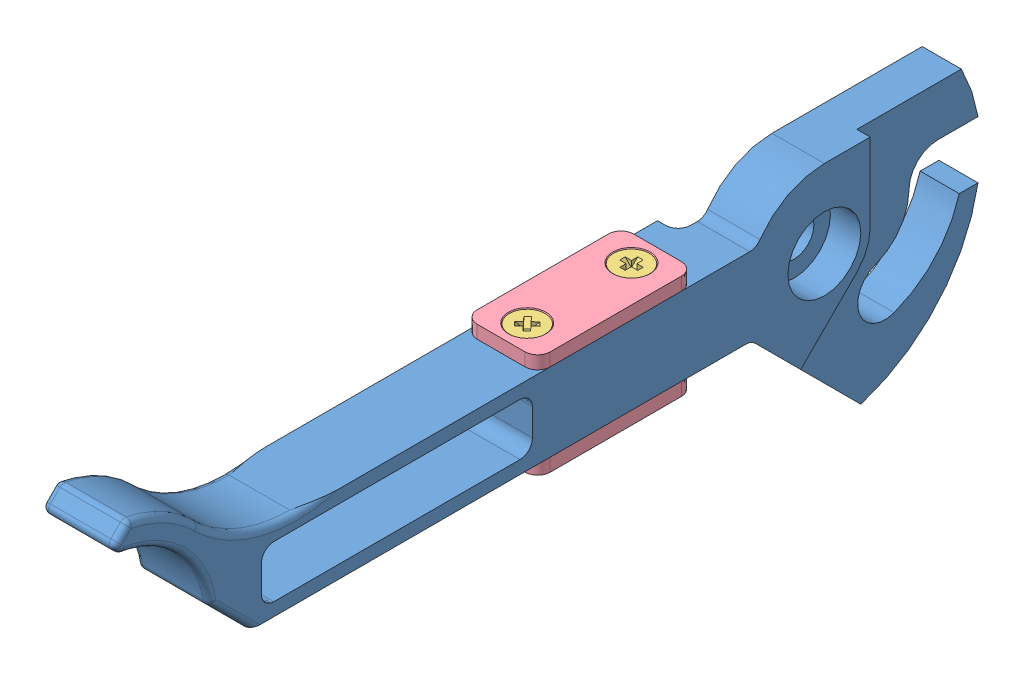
SolidWorks assembly Clevis arm assy.SLDASM, configuration Default (file format 10000). Lengths in mm.
Overall size (9.28 34.01 106.72).
12 component instances, 4 part files, 6 mates.
Components (placement in the parent):
- A9SP-1500-M561-3_ASM-1: A9SP-1500-M561-3_ASM.sldasm [Default] at (-67.2369 24.4733 -12.3202) size (9.28 34.01 106.72)
  - A9SP-1500-M561-31_AF0-1: A9SP-1500-M561-31_AF0.sldprt [Default] x (-1 0 0) z (0 0 1) size (9.28 34.01 106.72)
  - 93365A110_MMC_BRASS_INSERT-1: 93365A110_MMC_BRASS_INSERT.sldprt [Default] at (0 4.7625 31.75) x (-0.707107 0 -0.707107) z (0.707107 0 -0.707107) size (3.58 2.96 3.58)
  - 93365A110_MMC_BRASS_INSERT-2: 93365A110_MMC_BRASS_INSERT.sldprt [Default] at (0 4.7625 19.05) x (-0.707107 0 -0.707107) z (0.707107 0 -0.707107) size (3.58 2.96 3.58)
  - 93365A110_MMC_BRASS_INSERT-3: 93365A110_MMC_BRASS_INSERT.sldprt [Default] at (0 -4.7625 31.75) x (0.707107 0 0.707107) z (0.707107 0 -0.707107) size (3.58 2.96 3.58)
  - 93365A110_MMC_BRASS_INSERT-4: 93365A110_MMC_BRASS_INSERT.sldprt [Default] at (0 -4.7625 19.05) x (0.707107 0 0.707107) z (0.707107 0 -0.707107) size (3.58 2.96 3.58)
- MMC_93085A015-1: MMC_93085A015.sldprt [Default] at (-67.2369 30.738 19.4298) x (0.730342 0 -0.683081) z (0 1 0) size (4.37 4.37 4.75)
- MMC_93085A015-2: MMC_93085A015.sldprt [Default] at (-67.2369 30.738 6.7298) x (1 0 0) z (0 1 0) size (4.37 4.37 4.75)
- A9SP-1500-M561-5-1: A9SP-1500-M561-5.sldprt [Default] at (-67.2369 29.2358 13.0798) x (0 1 0) z (1 0 0) size (1.59 19.05 8.89)
- A9SP-1500-M561-5-2: A9SP-1500-M561-5.sldprt [Default] at (-67.2369 19.7108 13.0798) x (0 -1 0) z (-1 0 0) size (1.59 19.05 8.89)
- MMC_93085A015-3: MMC_93085A015.sldprt [Default] at (-67.2369 18.2085 6.7298) x (-1 0 0) z (0 -1 0) size (4.37 4.37 4.75)
- MMC_93085A015-4: MMC_93085A015.sldprt [Default] at (-67.2369 18.2085 19.4298) x (-0.730342 0 0.683081) z (0 -1 0) size (4.37 4.37 4.75)
Mates (geometry in assembly coordinates):
- Coincident1: coincident aligned: axis of A9SP-1500-M561-3_ASM-1/A9SP-1500-M561-31_AF0-1 through (-67.2369 29.2358 19.4298) axis (0 -1 0); axis of A9SP-1500-M561-5-1 through (-67.2369 30.8233 19.4298) axis (0 -1 0)
- Coincident2: coincident aligned: axis of A9SP-1500-M561-3_ASM-1/A9SP-1500-M561-31_AF0-1 through (-67.2369 29.2358 6.7298) axis (0 -1 0); axis of A9SP-1500-M561-5-1 through (-67.2369 30.8233 6.7298) axis (0 -1 0)
- Coincident3: coincident anti-aligned: plane of A9SP-1500-M561-3_ASM-1/A9SP-1500-M561-31_AF0-1 through (-55.3446 29.2358 -4.0713) normal (0 1 0); plane of A9SP-1500-M561-5-1 through (-67.2369 29.2358 13.0798) normal (0 -1 0)
- Coincident4: coincident aligned: axis of A9SP-1500-M561-3_ASM-1/A9SP-1500-M561-31_AF0-1 through (-67.2369 29.2358 19.4298) axis (0 -1 0); axis of MMC_93085A015-1 through (-67.2369 29.8215 19.4298) axis (0 -1 0)
- Coincident5: coincident aligned: cone of MMC_93085A015-1 through (-67.2369 30.738 19.4298) axis (0 -1 0); cone of A9SP-1500-M561-5-1 through (-67.2369 30.8233 19.4298) axis (0 -1 0)
- Coincident6: coincident aligned: cone of MMC_93085A015-2 through (-67.2369 30.738 6.7298) axis (0 -1 0); cone of A9SP-1500-M561-5-1 through (-67.2369 30.8233 6.7298) axis (0 -1 0)
